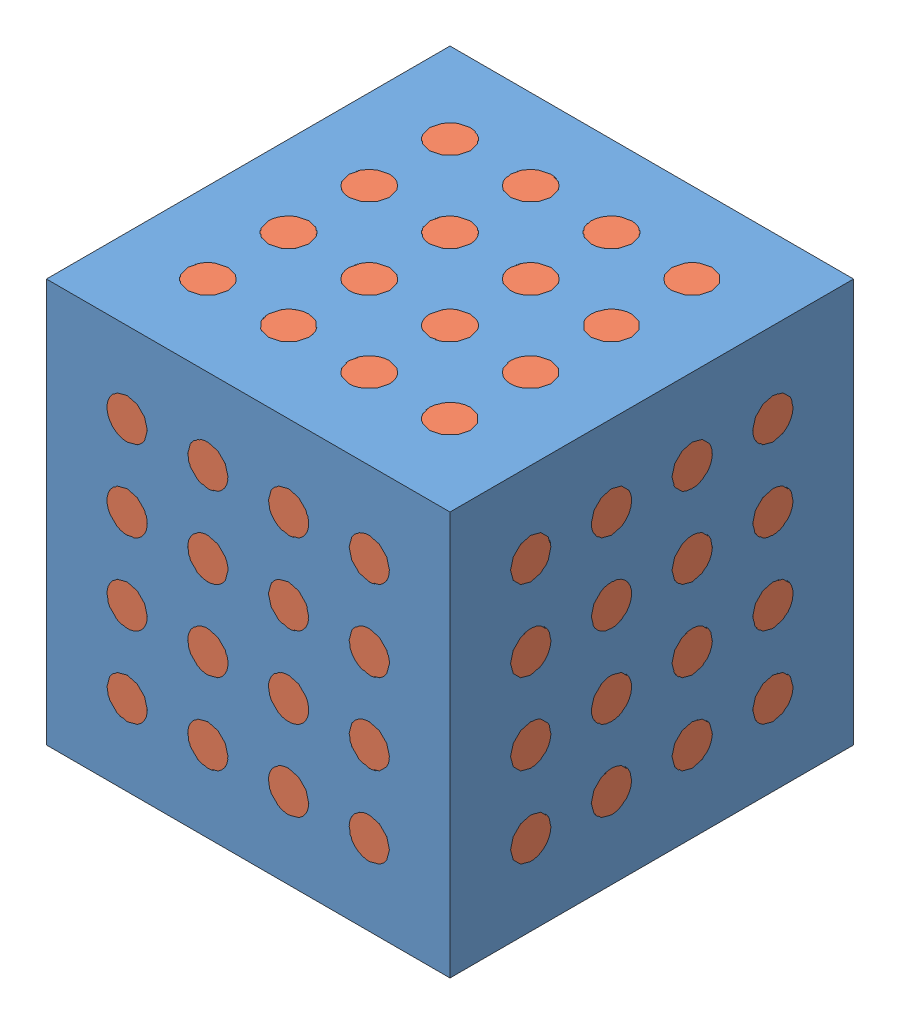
SolidWorks assembly asm_Wuerfel.SLDASM, configuration Standard (file format 4400). Lengths in mm.
Overall size (50 50 50).
49 component instances, 2 part files, 5 mates.
Components (placement in the parent):
- prt_Wuerfel-1: prt_Wuerfel.SLDPRT [Standard] at (-65.3977 -4.8678 -25) size (50 50 50)
- prt_Stopfen-1: prt_Stopfen.SLDPRT [Standard] at (-55.3977 35.1322 20) x (-0.332312 0.943169 0) z (0 0 1) size (5 5 5)
- prt_Stopfen-2: prt_Stopfen.SLDPRT [Standard] at (-55.3977 25.1322 20) x (-0.332312 0.943169 0) z (0 0 1) size (5 5 5)
- prt_Stopfen-3: prt_Stopfen.SLDPRT [Standard] at (-55.3977 15.1322 20) x (-0.332312 0.943169 0) z (0 0 1) size (5 5 5)
- prt_Stopfen-4: prt_Stopfen.SLDPRT [Standard] at (-55.3977 5.1322 20) x (-0.332312 0.943169 0) z (0 0 1) size (5 5 5)
- prt_Stopfen-5: prt_Stopfen.SLDPRT [Standard] at (-45.3977 35.1322 20) x (-0.332312 0.943169 0) z (0 0 1) size (5 5 5)
- prt_Stopfen-6: prt_Stopfen.SLDPRT [Standard] at (-45.3977 25.1322 20) x (-0.332312 0.943169 0) z (0 0 1) size (5 5 5)
- prt_Stopfen-7: prt_Stopfen.SLDPRT [Standard] at (-45.3977 15.1322 20) x (-0.332312 0.943169 0) z (0 0 1) size (5 5 5)
- prt_Stopfen-8: prt_Stopfen.SLDPRT [Standard] at (-45.3977 5.1322 20) x (-0.332312 0.943169 0) z (0 0 1) size (5 5 5)
- prt_Stopfen-9: prt_Stopfen.SLDPRT [Standard] at (-35.3977 35.1322 20) x (-0.332312 0.943169 0) z (0 0 1) size (5 5 5)
- prt_Stopfen-10: prt_Stopfen.SLDPRT [Standard] at (-35.3977 25.1322 20) x (-0.332312 0.943169 0) z (0 0 1) size (5 5 5)
- prt_Stopfen-11: prt_Stopfen.SLDPRT [Standard] at (-35.3977 15.1322 20) x (-0.332312 0.943169 0) z (0 0 1) size (5 5 5)
- prt_Stopfen-12: prt_Stopfen.SLDPRT [Standard] at (-35.3977 5.1322 20) x (-0.332312 0.943169 0) z (0 0 1) size (5 5 5)
- prt_Stopfen-13: prt_Stopfen.SLDPRT [Standard] at (-25.3977 35.1322 20) x (-0.332312 0.943169 0) z (0 0 1) size (5 5 5)
- prt_Stopfen-14: prt_Stopfen.SLDPRT [Standard] at (-25.3977 25.1322 20) x (-0.332312 0.943169 0) z (0 0 1) size (5 5 5)
- prt_Stopfen-15: prt_Stopfen.SLDPRT [Standard] at (-25.3977 15.1322 20) x (-0.332312 0.943169 0) z (0 0 1) size (5 5 5)
- prt_Stopfen-16: prt_Stopfen.SLDPRT [Standard] at (-25.3977 5.1322 20) x (-0.332312 0.943169 0) z (0 0 1) size (5 5 5)
- prt_Stopfen-17: prt_Stopfen.SLDPRT [Standard] at (-20.3977 35.1322 15) x (0 -0.924225 -0.381849) z (1 0 0) size (5 5 5)
- prt_Stopfen-18: prt_Stopfen.SLDPRT [Standard] at (-20.3977 25.1322 15) x (0 -0.924225 -0.381849) z (1 0 0) size (5 5 5)
- prt_Stopfen-19: prt_Stopfen.SLDPRT [Standard] at (-20.3977 15.1322 15) x (0 -0.924225 -0.381849) z (1 0 0) size (5 5 5)
- prt_Stopfen-20: prt_Stopfen.SLDPRT [Standard] at (-20.3977 5.1322 15) x (0 -0.924225 -0.381849) z (1 0 0) size (5 5 5)
- prt_Stopfen-21: prt_Stopfen.SLDPRT [Standard] at (-20.3977 35.1322 5) x (0 -0.924225 -0.381849) z (1 0 0) size (5 5 5)
- prt_Stopfen-22: prt_Stopfen.SLDPRT [Standard] at (-20.3977 25.1322 5) x (0 -0.924225 -0.381849) z (1 0 0) size (5 5 5)
- prt_Stopfen-23: prt_Stopfen.SLDPRT [Standard] at (-20.3977 15.1322 5) x (0 -0.924225 -0.381849) z (1 0 0) size (5 5 5)
- prt_Stopfen-24: prt_Stopfen.SLDPRT [Standard] at (-20.3977 5.1322 5) x (0 -0.924225 -0.381849) z (1 0 0) size (5 5 5)
- prt_Stopfen-25: prt_Stopfen.SLDPRT [Standard] at (-20.3977 35.1322 -5) x (0 -0.924225 -0.381849) z (1 0 0) size (5 5 5)
- prt_Stopfen-26: prt_Stopfen.SLDPRT [Standard] at (-20.3977 25.1322 -5) x (0 -0.924225 -0.381849) z (1 0 0) size (5 5 5)
- prt_Stopfen-27: prt_Stopfen.SLDPRT [Standard] at (-20.3977 15.1322 -5) x (0 -0.924225 -0.381849) z (1 0 0) size (5 5 5)
- prt_Stopfen-28: prt_Stopfen.SLDPRT [Standard] at (-20.3977 5.1322 -5) x (0 -0.924225 -0.381849) z (1 0 0) size (5 5 5)
- prt_Stopfen-29: prt_Stopfen.SLDPRT [Standard] at (-20.3977 35.1322 -15) x (0 -0.924225 -0.381849) z (1 0 0) size (5 5 5)
- prt_Stopfen-30: prt_Stopfen.SLDPRT [Standard] at (-20.3977 25.1322 -15) x (0 -0.924225 -0.381849) z (1 0 0) size (5 5 5)
- prt_Stopfen-31: prt_Stopfen.SLDPRT [Standard] at (-20.3977 15.1322 -15) x (0 -0.924225 -0.381849) z (1 0 0) size (5 5 5)
- prt_Stopfen-32: prt_Stopfen.SLDPRT [Standard] at (-20.3977 5.1322 -15) x (0 -0.924225 -0.381849) z (1 0 0) size (5 5 5)
- prt_Stopfen-33: prt_Stopfen.SLDPRT [Standard] at (-55.3977 40.1322 15) x (1 0 0) z (0 1 0) size (5 5 5)
- prt_Stopfen-34: prt_Stopfen.SLDPRT [Standard] at (-45.3977 40.1322 15) x (1 0 0) z (0 1 0) size (5 5 5)
- prt_Stopfen-35: prt_Stopfen.SLDPRT [Standard] at (-35.3977 40.1322 15) x (1 0 0) z (0 1 0) size (5 5 5)
- prt_Stopfen-36: prt_Stopfen.SLDPRT [Standard] at (-25.3977 40.1322 15) x (1 0 0) z (0 1 0) size (5 5 5)
- prt_Stopfen-37: prt_Stopfen.SLDPRT [Standard] at (-55.3977 40.1322 5) x (1 0 0) z (0 1 0) size (5 5 5)
- prt_Stopfen-38: prt_Stopfen.SLDPRT [Standard] at (-45.3977 40.1322 5) x (1 0 0) z (0 1 0) size (5 5 5)
- prt_Stopfen-39: prt_Stopfen.SLDPRT [Standard] at (-35.3977 40.1322 5) x (1 0 0) z (0 1 0) size (5 5 5)
- prt_Stopfen-40: prt_Stopfen.SLDPRT [Standard] at (-25.3977 40.1322 5) x (1 0 0) z (0 1 0) size (5 5 5)
- prt_Stopfen-41: prt_Stopfen.SLDPRT [Standard] at (-55.3977 40.1322 -5) x (1 0 0) z (0 1 0) size (5 5 5)
- prt_Stopfen-42: prt_Stopfen.SLDPRT [Standard] at (-45.3977 40.1322 -5) x (1 0 0) z (0 1 0) size (5 5 5)
- prt_Stopfen-43: prt_Stopfen.SLDPRT [Standard] at (-35.3977 40.1322 -5) x (1 0 0) z (0 1 0) size (5 5 5)
- prt_Stopfen-44: prt_Stopfen.SLDPRT [Standard] at (-25.3977 40.1322 -5) x (1 0 0) z (0 1 0) size (5 5 5)
- prt_Stopfen-45: prt_Stopfen.SLDPRT [Standard] at (-55.3977 40.1322 -15) x (1 0 0) z (0 1 0) size (5 5 5)
- prt_Stopfen-46: prt_Stopfen.SLDPRT [Standard] at (-45.3977 40.1322 -15) x (1 0 0) z (0 1 0) size (5 5 5)
- prt_Stopfen-47: prt_Stopfen.SLDPRT [Standard] at (-35.3977 40.1322 -15) x (1 0 0) z (0 1 0) size (5 5 5)
- prt_Stopfen-48: prt_Stopfen.SLDPRT [Standard] at (-25.3977 40.1322 -15) x (1 0 0) z (0 1 0) size (5 5 5)
Mates (geometry in assembly coordinates):
- Deckungsgleich2: coincident aligned: circle of prt_Wuerfel-1; circle of prt_Stopfen-17
- Deckungsgleich3: coincident aligned: circle of prt_Wuerfel-1; circle of prt_Stopfen-33
- Deckungsgleich4: coincident aligned: circle of prt_Wuerfel-1; circle of prt_Stopfen-1
- Lokales lineares Muster2: unknown: line of prt_Wuerfel-1 through (-15.3977 45.1322 25) axis (0 0 -1); line of prt_Wuerfel-1 through (-15.3977 -4.8678 25) axis (0 1 0)
- Lokales lineares Muster3: unknown: line of prt_Wuerfel-1 through (-65.3977 45.1322 25) axis (0 0 -1); line of prt_Wuerfel-1 through (-15.3977 45.1322 25) axis (-1 0 0)
